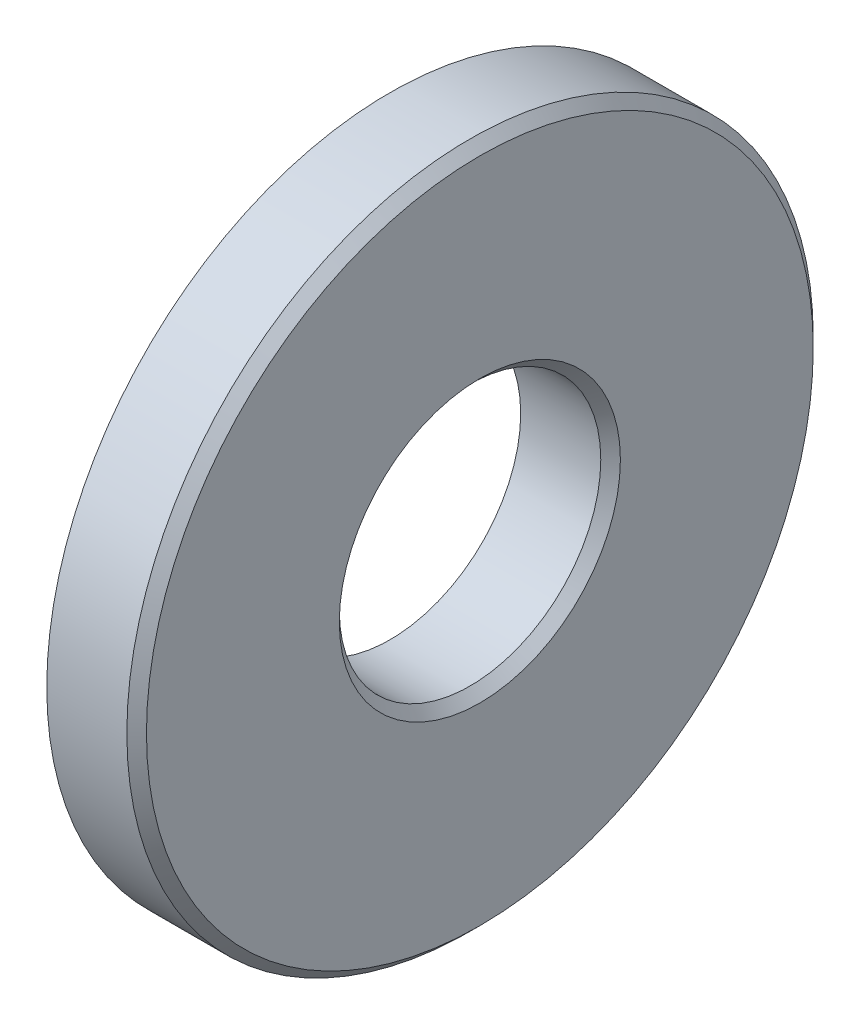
from build123d import *


with BuildPart() as part:
    # Esquisse1 → R_volution1 (revolve)
    with BuildSketch(Plane.XY, mode=Mode.PRIVATE) as r_volution1_sk:
        Polygon((0, 10.5), (0, 4), (2.45, 4), (2.75, 4.3), (2.75, 10.2), (2.45, 10.5), align=None)
    revolve(r_volution1_sk.sketch.rotate(Axis((0, 0, 0), (1, 0, 0)), 270), axis=Axis((0, 0, 0), (1, 0, 0)))


solid = part.part
